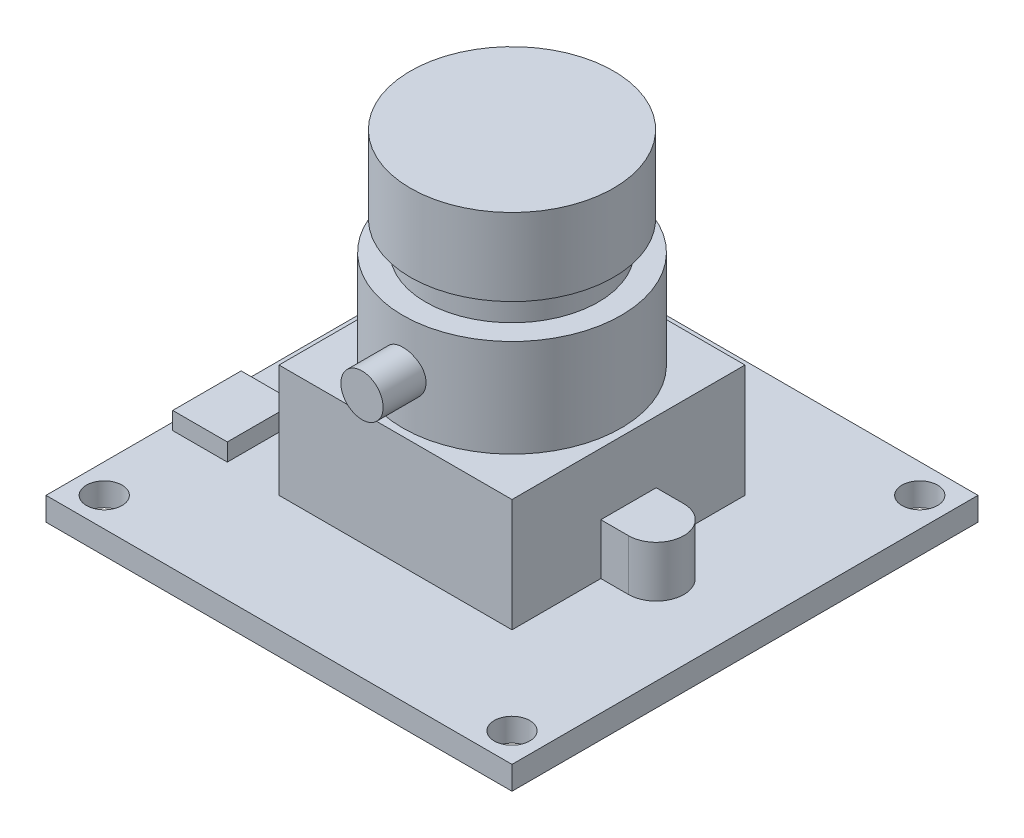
ISO-10303-21;
HEADER;
FILE_DESCRIPTION(('STEP AP214'),'2;1');
FILE_NAME('part.step','',(''),(''),'','','');
FILE_SCHEMA(('AUTOMOTIVE_DESIGN { 1 0 10303 214 1 1 1 1 }'));
ENDSEC;
DATA;
#1=APPLICATION_CONTEXT('core data for automotive mechanical design processes');
#2=APPLICATION_PROTOCOL_DEFINITION('international standard','automotive_design',2000,#1);
#3=PRODUCT_CONTEXT('',#1,'mechanical');
#4=PRODUCT('Part','Part','',(#3));
#5=PRODUCT_RELATED_PRODUCT_CATEGORY('part','',(#4));
#6=PRODUCT_DEFINITION_FORMATION('','',#4);
#7=PRODUCT_DEFINITION_CONTEXT('part definition',#1,'design');
#8=PRODUCT_DEFINITION('design','',#6,#7);
#9=PRODUCT_DEFINITION_SHAPE('','',#8);
#10=(LENGTH_UNIT() NAMED_UNIT(*) SI_UNIT(.MILLI.,.METRE.));
#11=(NAMED_UNIT(*) PLANE_ANGLE_UNIT() SI_UNIT($,.RADIAN.));
#12=(NAMED_UNIT(*) SI_UNIT($,.STERADIAN.) SOLID_ANGLE_UNIT());
#13=UNCERTAINTY_MEASURE_WITH_UNIT(LENGTH_MEASURE(1.E-05),#10,'distance_accuracy_value','');
#14=(GEOMETRIC_REPRESENTATION_CONTEXT(3) GLOBAL_UNCERTAINTY_ASSIGNED_CONTEXT((#13)) GLOBAL_UNIT_ASSIGNED_CONTEXT((#10,
#11,#12)) REPRESENTATION_CONTEXT('',''));
#15=CARTESIAN_POINT('',(0.,0.,0.));
#16=DIRECTION('',(0.,0.,1.));
#17=DIRECTION('',(1.,0.,0.));
#18=AXIS2_PLACEMENT_3D('',#15,#16,#17);
#19=CARTESIAN_POINT('',(16.,12.7,-11.3));
#20=DIRECTION('',(0.,0.,1.));
#21=DIRECTION('',(1.,0.,0.));
#22=AXIS2_PLACEMENT_3D('',#19,#20,#21);
#23=CYLINDRICAL_SURFACE('',#22,1.45);
#24=CARTESIAN_POINT('',(16.,12.7,-11.3));
#25=DIRECTION('',(0.,0.,1.));
#26=DIRECTION('',(1.,0.,0.));
#27=AXIS2_PLACEMENT_3D('',#24,#25,#26);
#28=CIRCLE('',#27,1.45);
#29=CARTESIAN_POINT('',(17.45,12.7,-11.3));
#30=VERTEX_POINT('',#29);
#31=EDGE_CURVE('E13',#30,#30,#28,.T.);
#32=ORIENTED_EDGE('',*,*,#31,.T.);
#33=EDGE_LOOP('',(#32));
#34=FACE_BOUND('',#33,.T.);
#35=CARTESIAN_POINT('',(16.,12.7,-5.7));
#36=DIRECTION('',(0.,0.,1.));
#37=DIRECTION('',(1.,0.,0.));
#38=AXIS2_PLACEMENT_3D('',#35,#36,#37);
#39=CIRCLE('',#38,1.45);
#40=CARTESIAN_POINT('',(17.45,12.7,-5.7));
#41=VERTEX_POINT('',#40);
#42=EDGE_CURVE('E63',#41,#41,#39,.T.);
#43=ORIENTED_EDGE('',*,*,#42,.F.);
#44=EDGE_LOOP('',(#43));
#45=FACE_BOUND('',#44,.T.);
#46=ADVANCED_FACE('F57',(#34,#45),#23,.T.);
#47=CARTESIAN_POINT('',(16.,12.7,-11.3));
#48=DIRECTION('',(0.,0.,1.));
#49=DIRECTION('',(1.,0.,0.));
#50=AXIS2_PLACEMENT_3D('',#47,#48,#49);
#51=PLANE('',#50);
#52=ORIENTED_EDGE('',*,*,#31,.F.);
#53=EDGE_LOOP('',(#52));
#54=FACE_BOUND('',#53,.T.);
#55=ADVANCED_FACE('F72',(#54),#51,.F.);
#56=CARTESIAN_POINT('',(16.,12.7,-5.7));
#57=DIRECTION('',(0.,0.,1.));
#58=DIRECTION('',(1.,0.,0.));
#59=AXIS2_PLACEMENT_3D('',#56,#57,#58);
#60=PLANE('',#59);
#61=ORIENTED_EDGE('',*,*,#42,.T.);
#62=EDGE_LOOP('',(#61));
#63=FACE_BOUND('',#62,.T.);
#64=ADVANCED_FACE('F69',(#63),#60,.T.);
#65=CLOSED_SHELL('',(#46,#55,#64));
#66=MANIFOLD_SOLID_BREP('B2',#65);
#67=CARTESIAN_POINT('',(0.,0.,0.));
#68=DIRECTION('',(0.,-1.,0.));
#69=DIRECTION('',(0.,0.,-1.));
#70=AXIS2_PLACEMENT_3D('',#67,#68,#69);
#71=PLANE('',#70);
#72=CARTESIAN_POINT('',(30.,0.,-2.));
#73=DIRECTION('',(0.,1.,0.));
#74=DIRECTION('',(0.,0.,1.));
#75=AXIS2_PLACEMENT_3D('',#72,#73,#74);
#76=CIRCLE('',#75,1.22);
#77=CARTESIAN_POINT('',(30.,0.,-0.779999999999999));
#78=VERTEX_POINT('',#77);
#79=EDGE_CURVE('E435',#78,#78,#76,.T.);
#80=ORIENTED_EDGE('',*,*,#79,.T.);
#81=EDGE_LOOP('',(#80));
#82=FACE_BOUND('',#81,.T.);
#83=CARTESIAN_POINT('',(2.,0.,-30.));
#84=DIRECTION('',(0.,1.,0.));
#85=DIRECTION('',(0.,0.,1.));
#86=AXIS2_PLACEMENT_3D('',#83,#84,#85);
#87=CIRCLE('',#86,1.22);
#88=CARTESIAN_POINT('',(2.,0.,-28.78));
#89=VERTEX_POINT('',#88);
#90=EDGE_CURVE('E447',#89,#89,#87,.T.);
#91=ORIENTED_EDGE('',*,*,#90,.T.);
#92=EDGE_LOOP('',(#91));
#93=FACE_BOUND('',#92,.T.);
#94=DIRECTION('',(0.,0.,1.));
#95=VECTOR('',#94,1.);
#96=CARTESIAN_POINT('',(0.,0.,0.));
#97=LINE('',#96,#95);
#98=CARTESIAN_POINT('',(0.,0.,-32.));
#99=VERTEX_POINT('',#98);
#100=CARTESIAN_POINT('',(0.,0.,0.));
#101=VERTEX_POINT('',#100);
#102=EDGE_CURVE('E453',#99,#101,#97,.T.);
#103=ORIENTED_EDGE('',*,*,#102,.F.);
#104=DIRECTION('',(-1.,0.,0.));
#105=VECTOR('',#104,1.);
#106=CARTESIAN_POINT('',(0.,0.,-32.));
#107=LINE('',#106,#105);
#108=CARTESIAN_POINT('',(32.,0.,-32.));
#109=VERTEX_POINT('',#108);
#110=EDGE_CURVE('E460',#109,#99,#107,.T.);
#111=ORIENTED_EDGE('',*,*,#110,.F.);
#112=DIRECTION('',(0.,0.,-1.));
#113=VECTOR('',#112,1.);
#114=CARTESIAN_POINT('',(32.,0.,0.));
#115=LINE('',#114,#113);
#116=CARTESIAN_POINT('',(32.,0.,0.));
#117=VERTEX_POINT('',#116);
#118=EDGE_CURVE('E471',#117,#109,#115,.T.);
#119=ORIENTED_EDGE('',*,*,#118,.F.);
#120=DIRECTION('',(1.,0.,0.));
#121=VECTOR('',#120,1.);
#122=CARTESIAN_POINT('',(0.,0.,0.));
#123=LINE('',#122,#121);
#124=EDGE_CURVE('E469',#101,#117,#123,.T.);
#125=ORIENTED_EDGE('',*,*,#124,.F.);
#126=EDGE_LOOP('',(#103,#111,#119,#125));
#127=FACE_BOUND('',#126,.T.);
#128=CARTESIAN_POINT('',(2.,0.,-2.));
#129=DIRECTION('',(0.,1.,0.));
#130=DIRECTION('',(0.,0.,1.));
#131=AXIS2_PLACEMENT_3D('',#128,#129,#130);
#132=CIRCLE('',#131,1.22);
#133=CARTESIAN_POINT('',(2.,0.,-0.78));
#134=VERTEX_POINT('',#133);
#135=EDGE_CURVE('E441',#134,#134,#132,.T.);
#136=ORIENTED_EDGE('',*,*,#135,.T.);
#137=EDGE_LOOP('',(#136));
#138=FACE_BOUND('',#137,.T.);
#139=CARTESIAN_POINT('',(30.,0.,-30.));
#140=DIRECTION('',(0.,1.,0.));
#141=DIRECTION('',(0.,0.,1.));
#142=AXIS2_PLACEMENT_3D('',#139,#140,#141);
#143=CIRCLE('',#142,1.22);
#144=CARTESIAN_POINT('',(30.,0.,-28.78));
#145=VERTEX_POINT('',#144);
#146=EDGE_CURVE('E431',#145,#145,#143,.T.);
#147=ORIENTED_EDGE('',*,*,#146,.T.);
#148=EDGE_LOOP('',(#147));
#149=FACE_BOUND('',#148,.T.);
#150=DIRECTION('',(1.,0.,0.));
#151=VECTOR('',#150,1.);
#152=CARTESIAN_POINT('',(5.9,0.,-31.75));
#153=LINE('',#152,#151);
#154=CARTESIAN_POINT('',(5.9,0.,-31.75));
#155=VERTEX_POINT('',#154);
#156=CARTESIAN_POINT('',(15.9,0.,-31.75));
#157=VERTEX_POINT('',#156);
#158=EDGE_CURVE('E881',#155,#157,#153,.T.);
#159=ORIENTED_EDGE('',*,*,#158,.F.);
#160=DIRECTION('',(0.,0.,-1.));
#161=VECTOR('',#160,1.);
#162=CARTESIAN_POINT('',(5.9,0.,-27.05));
#163=LINE('',#162,#161);
#164=CARTESIAN_POINT('',(5.9,0.,-27.05));
#165=VERTEX_POINT('',#164);
#166=EDGE_CURVE('E288',#165,#155,#163,.T.);
#167=ORIENTED_EDGE('',*,*,#166,.F.);
#168=DIRECTION('',(-1.,0.,0.));
#169=VECTOR('',#168,1.);
#170=CARTESIAN_POINT('',(5.9,0.,-27.05));
#171=LINE('',#170,#169);
#172=CARTESIAN_POINT('',(15.9,0.,-27.05));
#173=VERTEX_POINT('',#172);
#174=EDGE_CURVE('E284',#173,#165,#171,.T.);
#175=ORIENTED_EDGE('',*,*,#174,.F.);
#176=DIRECTION('',(0.,0.,1.));
#177=VECTOR('',#176,1.);
#178=CARTESIAN_POINT('',(15.9,0.,-27.05));
#179=LINE('',#178,#177);
#180=EDGE_CURVE('E878',#157,#173,#179,.T.);
#181=ORIENTED_EDGE('',*,*,#180,.F.);
#182=EDGE_LOOP('',(#159,#167,#175,#181));
#183=FACE_BOUND('',#182,.T.);
#184=ADVANCED_FACE('F104',(#82,#93,#127,#138,#149,#183),#71,.T.);
#185=CARTESIAN_POINT('',(0.,1.6,0.));
#186=DIRECTION('',(0.,-1.,0.));
#187=DIRECTION('',(0.,0.,-1.));
#188=AXIS2_PLACEMENT_3D('',#185,#186,#187);
#189=PLANE('',#188);
#190=DIRECTION('',(-1.,0.,0.));
#191=VECTOR('',#190,1.);
#192=CARTESIAN_POINT('',(25.9,1.6,-17.9));
#193=LINE('',#192,#191);
#194=CARTESIAN_POINT('',(25.9,1.6,-17.9));
#195=VERTEX_POINT('',#194);
#196=CARTESIAN_POINT('',(24.,1.6,-17.9));
#197=VERTEX_POINT('',#196);
#198=EDGE_CURVE('E339',#195,#197,#193,.T.);
#199=ORIENTED_EDGE('',*,*,#198,.F.);
#200=CARTESIAN_POINT('',(25.9,1.6,-16.));
#201=DIRECTION('',(0.,1.,0.));
#202=DIRECTION('',(0.,0.,1.));
#203=AXIS2_PLACEMENT_3D('',#200,#201,#202);
#204=CIRCLE('',#203,1.9);
#205=CARTESIAN_POINT('',(25.9,1.6,-14.1));
#206=VERTEX_POINT('',#205);
#207=EDGE_CURVE('E324',#206,#195,#204,.T.);
#208=ORIENTED_EDGE('',*,*,#207,.F.);
#209=DIRECTION('',(1.,0.,0.));
#210=VECTOR('',#209,1.);
#211=CARTESIAN_POINT('',(24.,1.6,-14.1));
#212=LINE('',#211,#210);
#213=CARTESIAN_POINT('',(24.,1.6,-14.1));
#214=VERTEX_POINT('',#213);
#215=EDGE_CURVE('E329',#214,#206,#212,.T.);
#216=ORIENTED_EDGE('',*,*,#215,.F.);
#217=DIRECTION('',(0.,0.,-1.));
#218=VECTOR('',#217,1.);
#219=CARTESIAN_POINT('',(24.,1.6,-24.));
#220=LINE('',#219,#218);
#221=CARTESIAN_POINT('',(24.,1.6,-8.));
#222=VERTEX_POINT('',#221);
#223=EDGE_CURVE('E415',#222,#214,#220,.T.);
#224=ORIENTED_EDGE('',*,*,#223,.F.);
#225=DIRECTION('',(1.,0.,0.));
#226=VECTOR('',#225,1.);
#227=CARTESIAN_POINT('',(8.,1.6,-8.));
#228=LINE('',#227,#226);
#229=CARTESIAN_POINT('',(8.,1.6,-8.));
#230=VERTEX_POINT('',#229);
#231=EDGE_CURVE('E411',#230,#222,#228,.T.);
#232=ORIENTED_EDGE('',*,*,#231,.F.);
#233=DIRECTION('',(0.,0.,1.));
#234=VECTOR('',#233,1.);
#235=CARTESIAN_POINT('',(8.00000000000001,1.6,-24.));
#236=LINE('',#235,#234);
#237=CARTESIAN_POINT('',(8.00000000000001,1.6,-14.1));
#238=VERTEX_POINT('',#237);
#239=EDGE_CURVE('E394',#238,#230,#236,.T.);
#240=ORIENTED_EDGE('',*,*,#239,.F.);
#241=DIRECTION('',(1.,0.,0.));
#242=VECTOR('',#241,1.);
#243=CARTESIAN_POINT('',(8.00000000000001,1.6,-14.1));
#244=LINE('',#243,#242);
#245=CARTESIAN_POINT('',(6.1,1.6,-14.1));
#246=VERTEX_POINT('',#245);
#247=EDGE_CURVE('E366',#246,#238,#244,.T.);
#248=ORIENTED_EDGE('',*,*,#247,.F.);
#249=CARTESIAN_POINT('',(6.10000000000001,1.6,-16.));
#250=DIRECTION('',(0.,1.,0.));
#251=DIRECTION('',(0.,0.,1.));
#252=AXIS2_PLACEMENT_3D('',#249,#250,#251);
#253=CIRCLE('',#252,1.9);
#254=CARTESIAN_POINT('',(6.1,1.6,-17.9));
#255=VERTEX_POINT('',#254);
#256=EDGE_CURVE('E351',#255,#246,#253,.T.);
#257=ORIENTED_EDGE('',*,*,#256,.F.);
#258=DIRECTION('',(-1.,0.,0.));
#259=VECTOR('',#258,1.);
#260=CARTESIAN_POINT('',(6.1,1.6,-17.9));
#261=LINE('',#260,#259);
#262=CARTESIAN_POINT('',(8.00000000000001,1.6,-17.9));
#263=VERTEX_POINT('',#262);
#264=EDGE_CURVE('E356',#263,#255,#261,.T.);
#265=ORIENTED_EDGE('',*,*,#264,.F.);
#266=CARTESIAN_POINT('',(8.00000000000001,1.6,-24.));
#267=VERTEX_POINT('',#266);
#268=EDGE_CURVE('E408',#267,#263,#236,.T.);
#269=ORIENTED_EDGE('',*,*,#268,.F.);
#270=DIRECTION('',(-1.,0.,0.));
#271=VECTOR('',#270,1.);
#272=CARTESIAN_POINT('',(8.00000000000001,1.6,-24.));
#273=LINE('',#272,#271);
#274=CARTESIAN_POINT('',(24.,1.6,-24.));
#275=VERTEX_POINT('',#274);
#276=EDGE_CURVE('E401',#275,#267,#273,.T.);
#277=ORIENTED_EDGE('',*,*,#276,.F.);
#278=EDGE_CURVE('E414',#197,#275,#220,.T.);
#279=ORIENTED_EDGE('',*,*,#278,.F.);
#280=EDGE_LOOP('',(#199,#208,#216,#224,#232,#240,#248,#257,#265,#269,#277,#279));
#281=FACE_BOUND('',#280,.T.);
#282=CARTESIAN_POINT('',(30.,1.6,-2.));
#283=DIRECTION('',(0.,1.,0.));
#284=DIRECTION('',(0.,0.,1.));
#285=AXIS2_PLACEMENT_3D('',#282,#283,#284);
#286=CIRCLE('',#285,1.22);
#287=CARTESIAN_POINT('',(30.,1.6,-0.779999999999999));
#288=VERTEX_POINT('',#287);
#289=EDGE_CURVE('E438',#288,#288,#286,.T.);
#290=ORIENTED_EDGE('',*,*,#289,.F.);
#291=EDGE_LOOP('',(#290));
#292=FACE_BOUND('',#291,.T.);
#293=CARTESIAN_POINT('',(2.,1.6,-30.));
#294=DIRECTION('',(0.,1.,0.));
#295=DIRECTION('',(0.,0.,1.));
#296=AXIS2_PLACEMENT_3D('',#293,#294,#295);
#297=CIRCLE('',#296,1.22);
#298=CARTESIAN_POINT('',(2.,1.6,-28.78));
#299=VERTEX_POINT('',#298);
#300=EDGE_CURVE('E450',#299,#299,#297,.T.);
#301=ORIENTED_EDGE('',*,*,#300,.F.);
#302=EDGE_LOOP('',(#301));
#303=FACE_BOUND('',#302,.T.);
#304=DIRECTION('',(0.,0.,1.));
#305=VECTOR('',#304,1.);
#306=CARTESIAN_POINT('',(0.,1.6,0.));
#307=LINE('',#306,#305);
#308=CARTESIAN_POINT('',(0.,1.6,-32.));
#309=VERTEX_POINT('',#308);
#310=CARTESIAN_POINT('',(0.,1.6,0.));
#311=VERTEX_POINT('',#310);
#312=EDGE_CURVE('E456',#309,#311,#307,.T.);
#313=ORIENTED_EDGE('',*,*,#312,.T.);
#314=DIRECTION('',(1.,0.,0.));
#315=VECTOR('',#314,1.);
#316=CARTESIAN_POINT('',(0.,1.6,0.));
#317=LINE('',#316,#315);
#318=CARTESIAN_POINT('',(32.,1.6,0.));
#319=VERTEX_POINT('',#318);
#320=EDGE_CURVE('E459',#311,#319,#317,.T.);
#321=ORIENTED_EDGE('',*,*,#320,.T.);
#322=DIRECTION('',(0.,0.,-1.));
#323=VECTOR('',#322,1.);
#324=CARTESIAN_POINT('',(32.,1.6,0.));
#325=LINE('',#324,#323);
#326=CARTESIAN_POINT('',(32.,1.6,-32.));
#327=VERTEX_POINT('',#326);
#328=EDGE_CURVE('E462',#319,#327,#325,.T.);
#329=ORIENTED_EDGE('',*,*,#328,.T.);
#330=DIRECTION('',(-1.,0.,0.));
#331=VECTOR('',#330,1.);
#332=CARTESIAN_POINT('',(0.,1.6,-32.));
#333=LINE('',#332,#331);
#334=EDGE_CURVE('E464',#327,#309,#333,.T.);
#335=ORIENTED_EDGE('',*,*,#334,.T.);
#336=EDGE_LOOP('',(#313,#321,#329,#335));
#337=FACE_BOUND('',#336,.T.);
#338=CARTESIAN_POINT('',(2.,1.6,-2.));
#339=DIRECTION('',(0.,1.,0.));
#340=DIRECTION('',(0.,0.,1.));
#341=AXIS2_PLACEMENT_3D('',#338,#339,#340);
#342=CIRCLE('',#341,1.22);
#343=CARTESIAN_POINT('',(2.,1.6,-0.78));
#344=VERTEX_POINT('',#343);
#345=EDGE_CURVE('E444',#344,#344,#342,.T.);
#346=ORIENTED_EDGE('',*,*,#345,.F.);
#347=EDGE_LOOP('',(#346));
#348=FACE_BOUND('',#347,.T.);
#349=CARTESIAN_POINT('',(30.,1.6,-30.));
#350=DIRECTION('',(0.,1.,0.));
#351=DIRECTION('',(0.,0.,1.));
#352=AXIS2_PLACEMENT_3D('',#349,#350,#351);
#353=CIRCLE('',#352,1.22);
#354=CARTESIAN_POINT('',(30.,1.6,-28.78));
#355=VERTEX_POINT('',#354);
#356=EDGE_CURVE('E432',#355,#355,#353,.T.);
#357=ORIENTED_EDGE('',*,*,#356,.F.);
#358=EDGE_LOOP('',(#357));
#359=FACE_BOUND('',#358,.T.);
#360=DIRECTION('',(0.,0.,-1.));
#361=VECTOR('',#360,1.);
#362=CARTESIAN_POINT('',(4.25,1.6,-8.2));
#363=LINE('',#362,#361);
#364=CARTESIAN_POINT('',(4.25,1.6,-8.2));
#365=VERTEX_POINT('',#364);
#366=CARTESIAN_POINT('',(4.25,1.6,-12.9));
#367=VERTEX_POINT('',#366);
#368=EDGE_CURVE('E290',#365,#367,#363,.T.);
#369=ORIENTED_EDGE('',*,*,#368,.F.);
#370=DIRECTION('',(1.,0.,0.));
#371=VECTOR('',#370,1.);
#372=CARTESIAN_POINT('',(4.25,1.6,-8.2));
#373=LINE('',#372,#371);
#374=CARTESIAN_POINT('',(0.5,1.6,-8.2));
#375=VERTEX_POINT('',#374);
#376=EDGE_CURVE('E301',#375,#365,#373,.T.);
#377=ORIENTED_EDGE('',*,*,#376,.F.);
#378=DIRECTION('',(0.,0.,1.));
#379=VECTOR('',#378,1.);
#380=CARTESIAN_POINT('',(0.5,1.6,-8.2));
#381=LINE('',#380,#379);
#382=CARTESIAN_POINT('',(0.5,1.6,-12.9));
#383=VERTEX_POINT('',#382);
#384=EDGE_CURVE('E309',#383,#375,#381,.T.);
#385=ORIENTED_EDGE('',*,*,#384,.F.);
#386=DIRECTION('',(-1.,0.,0.));
#387=VECTOR('',#386,1.);
#388=CARTESIAN_POINT('',(4.25,1.6,-12.9));
#389=LINE('',#388,#387);
#390=EDGE_CURVE('E127',#367,#383,#389,.T.);
#391=ORIENTED_EDGE('',*,*,#390,.F.);
#392=EDGE_LOOP('',(#369,#377,#385,#391));
#393=FACE_BOUND('',#392,.T.);
#394=ADVANCED_FACE('F498',(#281,#292,#303,#337,#348,#359,#393),#189,.F.);
#395=CARTESIAN_POINT('',(24.,9.35,-24.));
#396=DIRECTION('',(-1.,0.,0.));
#397=DIRECTION('',(0.,0.,1.));
#398=AXIS2_PLACEMENT_3D('',#395,#396,#397);
#399=PLANE('',#398);
#400=DIRECTION('',(0.,-1.,0.));
#401=VECTOR('',#400,1.);
#402=CARTESIAN_POINT('',(24.,5.1,-17.9));
#403=LINE('',#402,#401);
#404=CARTESIAN_POINT('',(24.,5.1,-17.9));
#405=VERTEX_POINT('',#404);
#406=EDGE_CURVE('E346',#405,#197,#403,.T.);
#407=ORIENTED_EDGE('',*,*,#406,.T.);
#408=ORIENTED_EDGE('',*,*,#278,.T.);
#409=DIRECTION('',(0.,-1.,0.));
#410=VECTOR('',#409,1.);
#411=CARTESIAN_POINT('',(24.,9.35,-24.));
#412=LINE('',#411,#410);
#413=CARTESIAN_POINT('',(24.,9.35,-24.));
#414=VERTEX_POINT('',#413);
#415=EDGE_CURVE('E422',#414,#275,#412,.T.);
#416=ORIENTED_EDGE('',*,*,#415,.F.);
#417=DIRECTION('',(0.,0.,-1.));
#418=VECTOR('',#417,1.);
#419=CARTESIAN_POINT('',(24.,9.35,-24.));
#420=LINE('',#419,#418);
#421=CARTESIAN_POINT('',(24.,9.35,-8.));
#422=VERTEX_POINT('',#421);
#423=EDGE_CURVE('E403',#422,#414,#420,.T.);
#424=ORIENTED_EDGE('',*,*,#423,.F.);
#425=DIRECTION('',(0.,-1.,0.));
#426=VECTOR('',#425,1.);
#427=CARTESIAN_POINT('',(24.,9.35,-8.));
#428=LINE('',#427,#426);
#429=EDGE_CURVE('E425',#422,#222,#428,.T.);
#430=ORIENTED_EDGE('',*,*,#429,.T.);
#431=ORIENTED_EDGE('',*,*,#223,.T.);
#432=DIRECTION('',(0.,-1.,0.));
#433=VECTOR('',#432,1.);
#434=CARTESIAN_POINT('',(24.,5.1,-14.1));
#435=LINE('',#434,#433);
#436=CARTESIAN_POINT('',(24.,5.1,-14.1));
#437=VERTEX_POINT('',#436);
#438=EDGE_CURVE('E344',#437,#214,#435,.T.);
#439=ORIENTED_EDGE('',*,*,#438,.F.);
#440=DIRECTION('',(0.,0.,1.));
#441=VECTOR('',#440,1.);
#442=CARTESIAN_POINT('',(24.,5.1,-17.9));
#443=LINE('',#442,#441);
#444=EDGE_CURVE('E332',#405,#437,#443,.T.);
#445=ORIENTED_EDGE('',*,*,#444,.F.);
#446=EDGE_LOOP('',(#407,#408,#416,#424,#430,#431,#439,#445));
#447=FACE_BOUND('',#446,.T.);
#448=ADVANCED_FACE('F514',(#447),#399,.F.);
#449=CARTESIAN_POINT('',(8.00000000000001,9.35,-24.));
#450=DIRECTION('',(1.,0.,0.));
#451=DIRECTION('',(0.,0.,-1.));
#452=AXIS2_PLACEMENT_3D('',#449,#450,#451);
#453=PLANE('',#452);
#454=DIRECTION('',(0.,-1.,0.));
#455=VECTOR('',#454,1.);
#456=CARTESIAN_POINT('',(8.00000000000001,5.1,-14.1));
#457=LINE('',#456,#455);
#458=CARTESIAN_POINT('',(8.,5.1,-14.1));
#459=VERTEX_POINT('',#458);
#460=EDGE_CURVE('E373',#459,#238,#457,.T.);
#461=ORIENTED_EDGE('',*,*,#460,.T.);
#462=ORIENTED_EDGE('',*,*,#239,.T.);
#463=DIRECTION('',(0.,-1.,0.));
#464=VECTOR('',#463,1.);
#465=CARTESIAN_POINT('',(8.,9.35,-8.));
#466=LINE('',#465,#464);
#467=CARTESIAN_POINT('',(8.,9.35,-8.));
#468=VERTEX_POINT('',#467);
#469=EDGE_CURVE('E428',#468,#230,#466,.T.);
#470=ORIENTED_EDGE('',*,*,#469,.F.);
#471=DIRECTION('',(0.,0.,1.));
#472=VECTOR('',#471,1.);
#473=CARTESIAN_POINT('',(8.00000000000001,9.35,-24.));
#474=LINE('',#473,#472);
#475=CARTESIAN_POINT('',(8.00000000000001,9.35,-24.));
#476=VERTEX_POINT('',#475);
#477=EDGE_CURVE('E397',#476,#468,#474,.T.);
#478=ORIENTED_EDGE('',*,*,#477,.F.);
#479=DIRECTION('',(0.,-1.,0.));
#480=VECTOR('',#479,1.);
#481=CARTESIAN_POINT('',(8.00000000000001,9.35,-24.));
#482=LINE('',#481,#480);
#483=EDGE_CURVE('E407',#476,#267,#482,.T.);
#484=ORIENTED_EDGE('',*,*,#483,.T.);
#485=ORIENTED_EDGE('',*,*,#268,.T.);
#486=DIRECTION('',(0.,-1.,0.));
#487=VECTOR('',#486,1.);
#488=CARTESIAN_POINT('',(8.00000000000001,5.1,-17.9));
#489=LINE('',#488,#487);
#490=CARTESIAN_POINT('',(8.00000000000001,5.1,-17.9));
#491=VERTEX_POINT('',#490);
#492=EDGE_CURVE('E371',#491,#263,#489,.T.);
#493=ORIENTED_EDGE('',*,*,#492,.F.);
#494=DIRECTION('',(0.,0.,-1.));
#495=VECTOR('',#494,1.);
#496=CARTESIAN_POINT('',(8.00000000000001,5.1,-17.9));
#497=LINE('',#496,#495);
#498=EDGE_CURVE('E359',#459,#491,#497,.T.);
#499=ORIENTED_EDGE('',*,*,#498,.F.);
#500=EDGE_LOOP('',(#461,#462,#470,#478,#484,#485,#493,#499));
#501=FACE_BOUND('',#500,.T.);
#502=ADVANCED_FACE('F543',(#501),#453,.F.);
#503=CARTESIAN_POINT('',(16.,16.05,-16.));
#504=DIRECTION('',(0.,1.,0.));
#505=DIRECTION('',(0.,0.,1.));
#506=AXIS2_PLACEMENT_3D('',#503,#504,#505);
#507=PLANE('',#506);
#508=CARTESIAN_POINT('',(16.,16.05,-16.));
#509=DIRECTION('',(0.,1.,0.));
#510=DIRECTION('',(0.,0.,1.));
#511=AXIS2_PLACEMENT_3D('',#508,#509,#510);
#512=CIRCLE('',#511,7.5);
#513=CARTESIAN_POINT('',(16.,16.05,-8.5));
#514=VERTEX_POINT('',#513);
#515=EDGE_CURVE('E391',#514,#514,#512,.T.);
#516=ORIENTED_EDGE('',*,*,#515,.T.);
#517=EDGE_LOOP('',(#516));
#518=FACE_BOUND('',#517,.T.);
#519=CARTESIAN_POINT('',(16.,16.05,-16.));
#520=DIRECTION('',(0.,1.,0.));
#521=DIRECTION('',(0.,0.,1.));
#522=AXIS2_PLACEMENT_3D('',#519,#520,#521);
#523=CIRCLE('',#522,5.925);
#524=CARTESIAN_POINT('',(16.,16.05,-10.075));
#525=VERTEX_POINT('',#524);
#526=EDGE_CURVE('E382',#525,#525,#523,.T.);
#527=ORIENTED_EDGE('',*,*,#526,.F.);
#528=EDGE_LOOP('',(#527));
#529=FACE_BOUND('',#528,.T.);
#530=ADVANCED_FACE('F546',(#518,#529),#507,.T.);
#531=CARTESIAN_POINT('',(0.,9.35,0.));
#532=DIRECTION('',(0.,1.,0.));
#533=DIRECTION('',(0.,0.,1.));
#534=AXIS2_PLACEMENT_3D('',#531,#532,#533);
#535=PLANE('',#534);
#536=ORIENTED_EDGE('',*,*,#477,.T.);
#537=DIRECTION('',(1.,0.,0.));
#538=VECTOR('',#537,1.);
#539=CARTESIAN_POINT('',(8.,9.35,-8.));
#540=LINE('',#539,#538);
#541=EDGE_CURVE('E400',#468,#422,#540,.T.);
#542=ORIENTED_EDGE('',*,*,#541,.T.);
#543=ORIENTED_EDGE('',*,*,#423,.T.);
#544=DIRECTION('',(-1.,0.,0.));
#545=VECTOR('',#544,1.);
#546=CARTESIAN_POINT('',(8.00000000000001,9.35,-24.));
#547=LINE('',#546,#545);
#548=EDGE_CURVE('E405',#414,#476,#547,.T.);
#549=ORIENTED_EDGE('',*,*,#548,.T.);
#550=EDGE_LOOP('',(#536,#542,#543,#549));
#551=FACE_BOUND('',#550,.T.);
#552=CARTESIAN_POINT('',(16.,9.35,-16.));
#553=DIRECTION('',(0.,1.,0.));
#554=DIRECTION('',(0.,0.,1.));
#555=AXIS2_PLACEMENT_3D('',#552,#553,#554);
#556=CIRCLE('',#555,7.5);
#557=CARTESIAN_POINT('',(16.,9.35,-8.5));
#558=VERTEX_POINT('',#557);
#559=EDGE_CURVE('E388',#558,#558,#556,.T.);
#560=ORIENTED_EDGE('',*,*,#559,.F.);
#561=EDGE_LOOP('',(#560));
#562=FACE_BOUND('',#561,.T.);
#563=ADVANCED_FACE('F507',(#551,#562),#535,.T.);
#564=CARTESIAN_POINT('',(0.,1.6,0.));
#565=DIRECTION('',(1.,0.,0.));
#566=DIRECTION('',(0.,0.,-1.));
#567=AXIS2_PLACEMENT_3D('',#564,#565,#566);
#568=PLANE('',#567);
#569=ORIENTED_EDGE('',*,*,#102,.T.);
#570=DIRECTION('',(0.,-1.,0.));
#571=VECTOR('',#570,1.);
#572=CARTESIAN_POINT('',(0.,1.6,0.));
#573=LINE('',#572,#571);
#574=EDGE_CURVE('E55',#311,#101,#573,.T.);
#575=ORIENTED_EDGE('',*,*,#574,.F.);
#576=ORIENTED_EDGE('',*,*,#312,.F.);
#577=DIRECTION('',(0.,-1.,0.));
#578=VECTOR('',#577,1.);
#579=CARTESIAN_POINT('',(0.,1.6,-32.));
#580=LINE('',#579,#578);
#581=EDGE_CURVE('E466',#309,#99,#580,.T.);
#582=ORIENTED_EDGE('',*,*,#581,.T.);
#583=EDGE_LOOP('',(#569,#575,#576,#582));
#584=FACE_BOUND('',#583,.T.);
#585=ADVANCED_FACE('F106',(#584),#568,.F.);
#586=CARTESIAN_POINT('',(0.,1.6,0.));
#587=DIRECTION('',(0.,0.,-1.));
#588=DIRECTION('',(-1.,0.,0.));
#589=AXIS2_PLACEMENT_3D('',#586,#587,#588);
#590=PLANE('',#589);
#591=ORIENTED_EDGE('',*,*,#124,.T.);
#592=DIRECTION('',(0.,-1.,0.));
#593=VECTOR('',#592,1.);
#594=CARTESIAN_POINT('',(32.,1.6,0.));
#595=LINE('',#594,#593);
#596=EDGE_CURVE('E112',#319,#117,#595,.T.);
#597=ORIENTED_EDGE('',*,*,#596,.F.);
#598=ORIENTED_EDGE('',*,*,#320,.F.);
#599=ORIENTED_EDGE('',*,*,#574,.T.);
#600=EDGE_LOOP('',(#591,#597,#598,#599));
#601=FACE_BOUND('',#600,.T.);
#602=ADVANCED_FACE('F500',(#601),#590,.F.);
#603=CARTESIAN_POINT('',(32.,1.6,0.));
#604=DIRECTION('',(-1.,0.,0.));
#605=DIRECTION('',(0.,0.,1.));
#606=AXIS2_PLACEMENT_3D('',#603,#604,#605);
#607=PLANE('',#606);
#608=ORIENTED_EDGE('',*,*,#118,.T.);
#609=DIRECTION('',(0.,-1.,0.));
#610=VECTOR('',#609,1.);
#611=CARTESIAN_POINT('',(32.,1.6,-32.));
#612=LINE('',#611,#610);
#613=EDGE_CURVE('E476',#327,#109,#612,.T.);
#614=ORIENTED_EDGE('',*,*,#613,.F.);
#615=ORIENTED_EDGE('',*,*,#328,.F.);
#616=ORIENTED_EDGE('',*,*,#596,.T.);
#617=EDGE_LOOP('',(#608,#614,#615,#616));
#618=FACE_BOUND('',#617,.T.);
#619=ADVANCED_FACE('F483',(#618),#607,.F.);
#620=CARTESIAN_POINT('',(0.,1.6,-32.));
#621=DIRECTION('',(0.,0.,1.));
#622=DIRECTION('',(1.,0.,0.));
#623=AXIS2_PLACEMENT_3D('',#620,#621,#622);
#624=PLANE('',#623);
#625=ORIENTED_EDGE('',*,*,#110,.T.);
#626=ORIENTED_EDGE('',*,*,#581,.F.);
#627=ORIENTED_EDGE('',*,*,#334,.F.);
#628=ORIENTED_EDGE('',*,*,#613,.T.);
#629=EDGE_LOOP('',(#625,#626,#627,#628));
#630=FACE_BOUND('',#629,.T.);
#631=ADVANCED_FACE('F492',(#630),#624,.F.);
#632=CARTESIAN_POINT('',(2.,1.6,-30.));
#633=DIRECTION('',(0.,-1.,0.));
#634=DIRECTION('',(0.,0.,-1.));
#635=AXIS2_PLACEMENT_3D('',#632,#633,#634);
#636=CYLINDRICAL_SURFACE('',#635,1.22);
#637=ORIENTED_EDGE('',*,*,#300,.T.);
#638=EDGE_LOOP('',(#637));
#639=FACE_BOUND('',#638,.T.);
#640=ORIENTED_EDGE('',*,*,#90,.F.);
#641=EDGE_LOOP('',(#640));
#642=FACE_BOUND('',#641,.T.);
#643=ADVANCED_FACE('F521',(#639,#642),#636,.F.);
#644=CARTESIAN_POINT('',(2.,1.6,-2.));
#645=DIRECTION('',(0.,-1.,0.));
#646=DIRECTION('',(0.,0.,-1.));
#647=AXIS2_PLACEMENT_3D('',#644,#645,#646);
#648=CYLINDRICAL_SURFACE('',#647,1.22);
#649=ORIENTED_EDGE('',*,*,#345,.T.);
#650=EDGE_LOOP('',(#649));
#651=FACE_BOUND('',#650,.T.);
#652=ORIENTED_EDGE('',*,*,#135,.F.);
#653=EDGE_LOOP('',(#652));
#654=FACE_BOUND('',#653,.T.);
#655=ADVANCED_FACE('F525',(#651,#654),#648,.F.);
#656=CARTESIAN_POINT('',(30.,1.6,-2.));
#657=DIRECTION('',(0.,-1.,0.));
#658=DIRECTION('',(0.,0.,-1.));
#659=AXIS2_PLACEMENT_3D('',#656,#657,#658);
#660=CYLINDRICAL_SURFACE('',#659,1.22);
#661=ORIENTED_EDGE('',*,*,#289,.T.);
#662=EDGE_LOOP('',(#661));
#663=FACE_BOUND('',#662,.T.);
#664=ORIENTED_EDGE('',*,*,#79,.F.);
#665=EDGE_LOOP('',(#664));
#666=FACE_BOUND('',#665,.T.);
#667=ADVANCED_FACE('F530',(#663,#666),#660,.F.);
#668=CARTESIAN_POINT('',(30.,1.6,-30.));
#669=DIRECTION('',(0.,-1.,0.));
#670=DIRECTION('',(0.,0.,-1.));
#671=AXIS2_PLACEMENT_3D('',#668,#669,#670);
#672=CYLINDRICAL_SURFACE('',#671,1.22);
#673=ORIENTED_EDGE('',*,*,#356,.T.);
#674=EDGE_LOOP('',(#673));
#675=FACE_BOUND('',#674,.T.);
#676=ORIENTED_EDGE('',*,*,#146,.F.);
#677=EDGE_LOOP('',(#676));
#678=FACE_BOUND('',#677,.T.);
#679=ADVANCED_FACE('F537',(#675,#678),#672,.F.);
#680=CARTESIAN_POINT('',(8.,9.35,-8.));
#681=DIRECTION('',(0.,0.,-1.));
#682=DIRECTION('',(-1.,0.,0.));
#683=AXIS2_PLACEMENT_3D('',#680,#681,#682);
#684=PLANE('',#683);
#685=ORIENTED_EDGE('',*,*,#231,.T.);
#686=ORIENTED_EDGE('',*,*,#429,.F.);
#687=ORIENTED_EDGE('',*,*,#541,.F.);
#688=ORIENTED_EDGE('',*,*,#469,.T.);
#689=EDGE_LOOP('',(#685,#686,#687,#688));
#690=FACE_BOUND('',#689,.T.);
#691=ADVANCED_FACE('F541',(#690),#684,.F.);
#692=CARTESIAN_POINT('',(8.00000000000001,9.35,-24.));
#693=DIRECTION('',(0.,0.,1.));
#694=DIRECTION('',(1.,0.,0.));
#695=AXIS2_PLACEMENT_3D('',#692,#693,#694);
#696=PLANE('',#695);
#697=ORIENTED_EDGE('',*,*,#276,.T.);
#698=ORIENTED_EDGE('',*,*,#483,.F.);
#699=ORIENTED_EDGE('',*,*,#548,.F.);
#700=ORIENTED_EDGE('',*,*,#415,.T.);
#701=EDGE_LOOP('',(#697,#698,#699,#700));
#702=FACE_BOUND('',#701,.T.);
#703=ADVANCED_FACE('F550',(#702),#696,.F.);
#704=CARTESIAN_POINT('',(16.,16.05,-16.));
#705=DIRECTION('',(0.,-1.,0.));
#706=DIRECTION('',(0.,0.,-1.));
#707=AXIS2_PLACEMENT_3D('',#704,#705,#706);
#708=CYLINDRICAL_SURFACE('',#707,7.5);
#709=ORIENTED_EDGE('',*,*,#515,.F.);
#710=EDGE_LOOP('',(#709));
#711=FACE_BOUND('',#710,.T.);
#712=ORIENTED_EDGE('',*,*,#559,.T.);
#713=EDGE_LOOP('',(#712));
#714=FACE_BOUND('',#713,.T.);
#715=ADVANCED_FACE('F557',(#711,#714),#708,.T.);
#716=CARTESIAN_POINT('',(16.,18.05,-16.));
#717=DIRECTION('',(0.,-1.,0.));
#718=DIRECTION('',(0.,0.,-1.));
#719=AXIS2_PLACEMENT_3D('',#716,#717,#718);
#720=CYLINDRICAL_SURFACE('',#719,5.925);
#721=CARTESIAN_POINT('',(16.,18.05,-16.));
#722=DIRECTION('',(0.,1.,0.));
#723=DIRECTION('',(0.,0.,1.));
#724=AXIS2_PLACEMENT_3D('',#721,#722,#723);
#725=CIRCLE('',#724,5.925);
#726=CARTESIAN_POINT('',(16.,18.05,-10.075));
#727=VERTEX_POINT('',#726);
#728=EDGE_CURVE('E385',#727,#727,#725,.T.);
#729=ORIENTED_EDGE('',*,*,#728,.F.);
#730=EDGE_LOOP('',(#729));
#731=FACE_BOUND('',#730,.T.);
#732=ORIENTED_EDGE('',*,*,#526,.T.);
#733=EDGE_LOOP('',(#732));
#734=FACE_BOUND('',#733,.T.);
#735=ADVANCED_FACE('F564',(#731,#734),#720,.T.);
#736=CARTESIAN_POINT('',(16.,18.05,-16.));
#737=DIRECTION('',(0.,1.,0.));
#738=DIRECTION('',(0.,0.,1.));
#739=AXIS2_PLACEMENT_3D('',#736,#737,#738);
#740=PLANE('',#739);
#741=CARTESIAN_POINT('',(16.,18.05,-16.));
#742=DIRECTION('',(0.,1.,0.));
#743=DIRECTION('',(0.,0.,1.));
#744=AXIS2_PLACEMENT_3D('',#741,#742,#743);
#745=CIRCLE('',#744,6.975);
#746=CARTESIAN_POINT('',(16.,18.05,-9.025));
#747=VERTEX_POINT('',#746);
#748=EDGE_CURVE('E378',#747,#747,#745,.T.);
#749=ORIENTED_EDGE('',*,*,#748,.F.);
#750=EDGE_LOOP('',(#749));
#751=FACE_BOUND('',#750,.T.);
#752=ORIENTED_EDGE('',*,*,#728,.T.);
#753=EDGE_LOOP('',(#752));
#754=FACE_BOUND('',#753,.T.);
#755=ADVANCED_FACE('F571',(#751,#754),#740,.F.);
#756=CARTESIAN_POINT('',(16.,23.35,-16.));
#757=DIRECTION('',(0.,-1.,0.));
#758=DIRECTION('',(0.,0.,-1.));
#759=AXIS2_PLACEMENT_3D('',#756,#757,#758);
#760=CYLINDRICAL_SURFACE('',#759,6.975);
#761=CARTESIAN_POINT('',(16.,23.35,-16.));
#762=DIRECTION('',(0.,1.,0.));
#763=DIRECTION('',(0.,0.,1.));
#764=AXIS2_PLACEMENT_3D('',#761,#762,#763);
#765=CIRCLE('',#764,6.975);
#766=CARTESIAN_POINT('',(16.,23.35,-9.025));
#767=VERTEX_POINT('',#766);
#768=EDGE_CURVE('E379',#767,#767,#765,.T.);
#769=ORIENTED_EDGE('',*,*,#768,.F.);
#770=EDGE_LOOP('',(#769));
#771=FACE_BOUND('',#770,.T.);
#772=ORIENTED_EDGE('',*,*,#748,.T.);
#773=EDGE_LOOP('',(#772));
#774=FACE_BOUND('',#773,.T.);
#775=ADVANCED_FACE('F573',(#771,#774),#760,.T.);
#776=CARTESIAN_POINT('',(16.,23.35,-16.));
#777=DIRECTION('',(0.,1.,0.));
#778=DIRECTION('',(0.,0.,1.));
#779=AXIS2_PLACEMENT_3D('',#776,#777,#778);
#780=PLANE('',#779);
#781=ORIENTED_EDGE('',*,*,#768,.T.);
#782=EDGE_LOOP('',(#781));
#783=FACE_BOUND('',#782,.T.);
#784=ADVANCED_FACE('F576',(#783),#780,.T.);
#785=CARTESIAN_POINT('',(6.10000000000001,5.1,-16.));
#786=DIRECTION('',(0.,-1.,0.));
#787=DIRECTION('',(0.,0.,-1.));
#788=AXIS2_PLACEMENT_3D('',#785,#786,#787);
#789=CYLINDRICAL_SURFACE('',#788,1.9);
#790=ORIENTED_EDGE('',*,*,#256,.T.);
#791=DIRECTION('',(0.,-1.,0.));
#792=VECTOR('',#791,1.);
#793=CARTESIAN_POINT('',(6.1,5.1,-14.1));
#794=LINE('',#793,#792);
#795=CARTESIAN_POINT('',(6.1,5.1,-14.1));
#796=VERTEX_POINT('',#795);
#797=EDGE_CURVE('E376',#796,#246,#794,.T.);
#798=ORIENTED_EDGE('',*,*,#797,.F.);
#799=CARTESIAN_POINT('',(6.10000000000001,5.1,-16.));
#800=DIRECTION('',(0.,1.,0.));
#801=DIRECTION('',(0.,0.,1.));
#802=AXIS2_PLACEMENT_3D('',#799,#800,#801);
#803=CIRCLE('',#802,1.9);
#804=CARTESIAN_POINT('',(6.1,5.1,-17.9));
#805=VERTEX_POINT('',#804);
#806=EDGE_CURVE('E352',#805,#796,#803,.T.);
#807=ORIENTED_EDGE('',*,*,#806,.F.);
#808=DIRECTION('',(0.,-1.,0.));
#809=VECTOR('',#808,1.);
#810=CARTESIAN_POINT('',(6.1,5.1,-17.9));
#811=LINE('',#810,#809);
#812=EDGE_CURVE('E363',#805,#255,#811,.T.);
#813=ORIENTED_EDGE('',*,*,#812,.T.);
#814=EDGE_LOOP('',(#790,#798,#807,#813));
#815=FACE_BOUND('',#814,.T.);
#816=ADVANCED_FACE('F583',(#815),#789,.T.);
#817=CARTESIAN_POINT('',(8.00000000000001,5.1,-14.1));
#818=DIRECTION('',(0.,0.,-1.));
#819=DIRECTION('',(-1.,0.,0.));
#820=AXIS2_PLACEMENT_3D('',#817,#818,#819);
#821=PLANE('',#820);
#822=ORIENTED_EDGE('',*,*,#247,.T.);
#823=ORIENTED_EDGE('',*,*,#460,.F.);
#824=DIRECTION('',(1.,0.,0.));
#825=VECTOR('',#824,1.);
#826=CARTESIAN_POINT('',(8.00000000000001,5.1,-14.1));
#827=LINE('',#826,#825);
#828=EDGE_CURVE('E355',#796,#459,#827,.T.);
#829=ORIENTED_EDGE('',*,*,#828,.F.);
#830=ORIENTED_EDGE('',*,*,#797,.T.);
#831=EDGE_LOOP('',(#822,#823,#829,#830));
#832=FACE_BOUND('',#831,.T.);
#833=ADVANCED_FACE('F587',(#832),#821,.F.);
#834=CARTESIAN_POINT('',(6.1,5.1,-17.9));
#835=DIRECTION('',(0.,0.,1.));
#836=DIRECTION('',(1.,0.,0.));
#837=AXIS2_PLACEMENT_3D('',#834,#835,#836);
#838=PLANE('',#837);
#839=ORIENTED_EDGE('',*,*,#264,.T.);
#840=ORIENTED_EDGE('',*,*,#812,.F.);
#841=DIRECTION('',(-1.,0.,0.));
#842=VECTOR('',#841,1.);
#843=CARTESIAN_POINT('',(6.1,5.1,-17.9));
#844=LINE('',#843,#842);
#845=EDGE_CURVE('E361',#491,#805,#844,.T.);
#846=ORIENTED_EDGE('',*,*,#845,.F.);
#847=ORIENTED_EDGE('',*,*,#492,.T.);
#848=EDGE_LOOP('',(#839,#840,#846,#847));
#849=FACE_BOUND('',#848,.T.);
#850=ADVANCED_FACE('F591',(#849),#838,.F.);
#851=CARTESIAN_POINT('',(6.10000000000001,5.1,-16.));
#852=DIRECTION('',(0.,1.,0.));
#853=DIRECTION('',(0.,0.,1.));
#854=AXIS2_PLACEMENT_3D('',#851,#852,#853);
#855=PLANE('',#854);
#856=ORIENTED_EDGE('',*,*,#806,.T.);
#857=ORIENTED_EDGE('',*,*,#828,.T.);
#858=ORIENTED_EDGE('',*,*,#498,.T.);
#859=ORIENTED_EDGE('',*,*,#845,.T.);
#860=EDGE_LOOP('',(#856,#857,#858,#859));
#861=FACE_BOUND('',#860,.T.);
#862=ADVANCED_FACE('F595',(#861),#855,.T.);
#863=CARTESIAN_POINT('',(25.9,5.1,-16.));
#864=DIRECTION('',(0.,-1.,0.));
#865=DIRECTION('',(0.,0.,-1.));
#866=AXIS2_PLACEMENT_3D('',#863,#864,#865);
#867=CYLINDRICAL_SURFACE('',#866,1.9);
#868=ORIENTED_EDGE('',*,*,#207,.T.);
#869=DIRECTION('',(0.,-1.,0.));
#870=VECTOR('',#869,1.);
#871=CARTESIAN_POINT('',(25.9,5.1,-17.9));
#872=LINE('',#871,#870);
#873=CARTESIAN_POINT('',(25.9,5.1,-17.9));
#874=VERTEX_POINT('',#873);
#875=EDGE_CURVE('E349',#874,#195,#872,.T.);
#876=ORIENTED_EDGE('',*,*,#875,.F.);
#877=CARTESIAN_POINT('',(25.9,5.1,-16.));
#878=DIRECTION('',(0.,1.,0.));
#879=DIRECTION('',(0.,0.,1.));
#880=AXIS2_PLACEMENT_3D('',#877,#878,#879);
#881=CIRCLE('',#880,1.9);
#882=CARTESIAN_POINT('',(25.9,5.1,-14.1));
#883=VERTEX_POINT('',#882);
#884=EDGE_CURVE('E325',#883,#874,#881,.T.);
#885=ORIENTED_EDGE('',*,*,#884,.F.);
#886=DIRECTION('',(0.,-1.,0.));
#887=VECTOR('',#886,1.);
#888=CARTESIAN_POINT('',(25.9,5.1,-14.1));
#889=LINE('',#888,#887);
#890=EDGE_CURVE('E336',#883,#206,#889,.T.);
#891=ORIENTED_EDGE('',*,*,#890,.T.);
#892=EDGE_LOOP('',(#868,#876,#885,#891));
#893=FACE_BOUND('',#892,.T.);
#894=ADVANCED_FACE('F599',(#893),#867,.T.);
#895=CARTESIAN_POINT('',(25.9,5.1,-17.9));
#896=DIRECTION('',(0.,0.,1.));
#897=DIRECTION('',(1.,0.,0.));
#898=AXIS2_PLACEMENT_3D('',#895,#896,#897);
#899=PLANE('',#898);
#900=ORIENTED_EDGE('',*,*,#198,.T.);
#901=ORIENTED_EDGE('',*,*,#406,.F.);
#902=DIRECTION('',(-1.,0.,0.));
#903=VECTOR('',#902,1.);
#904=CARTESIAN_POINT('',(25.9,5.1,-17.9));
#905=LINE('',#904,#903);
#906=EDGE_CURVE('E328',#874,#405,#905,.T.);
#907=ORIENTED_EDGE('',*,*,#906,.F.);
#908=ORIENTED_EDGE('',*,*,#875,.T.);
#909=EDGE_LOOP('',(#900,#901,#907,#908));
#910=FACE_BOUND('',#909,.T.);
#911=ADVANCED_FACE('F603',(#910),#899,.F.);
#912=CARTESIAN_POINT('',(24.,5.1,-14.1));
#913=DIRECTION('',(0.,0.,-1.));
#914=DIRECTION('',(-1.,0.,0.));
#915=AXIS2_PLACEMENT_3D('',#912,#913,#914);
#916=PLANE('',#915);
#917=ORIENTED_EDGE('',*,*,#215,.T.);
#918=ORIENTED_EDGE('',*,*,#890,.F.);
#919=DIRECTION('',(1.,0.,0.));
#920=VECTOR('',#919,1.);
#921=CARTESIAN_POINT('',(24.,5.1,-14.1));
#922=LINE('',#921,#920);
#923=EDGE_CURVE('E334',#437,#883,#922,.T.);
#924=ORIENTED_EDGE('',*,*,#923,.F.);
#925=ORIENTED_EDGE('',*,*,#438,.T.);
#926=EDGE_LOOP('',(#917,#918,#924,#925));
#927=FACE_BOUND('',#926,.T.);
#928=ADVANCED_FACE('F607',(#927),#916,.F.);
#929=CARTESIAN_POINT('',(25.9,5.1,-16.));
#930=DIRECTION('',(0.,1.,0.));
#931=DIRECTION('',(0.,0.,1.));
#932=AXIS2_PLACEMENT_3D('',#929,#930,#931);
#933=PLANE('',#932);
#934=ORIENTED_EDGE('',*,*,#884,.T.);
#935=ORIENTED_EDGE('',*,*,#906,.T.);
#936=ORIENTED_EDGE('',*,*,#444,.T.);
#937=ORIENTED_EDGE('',*,*,#923,.T.);
#938=EDGE_LOOP('',(#934,#935,#936,#937));
#939=FACE_BOUND('',#938,.T.);
#940=ADVANCED_FACE('F611',(#939),#933,.T.);
#941=CARTESIAN_POINT('',(4.25,2.8,-8.2));
#942=DIRECTION('',(-1.,0.,0.));
#943=DIRECTION('',(0.,0.,1.));
#944=AXIS2_PLACEMENT_3D('',#941,#942,#943);
#945=PLANE('',#944);
#946=ORIENTED_EDGE('',*,*,#368,.T.);
#947=DIRECTION('',(0.,-1.,0.));
#948=VECTOR('',#947,1.);
#949=CARTESIAN_POINT('',(4.25,2.8,-12.9));
#950=LINE('',#949,#948);
#951=CARTESIAN_POINT('',(4.25,2.8,-12.9));
#952=VERTEX_POINT('',#951);
#953=EDGE_CURVE('E322',#952,#367,#950,.T.);
#954=ORIENTED_EDGE('',*,*,#953,.F.);
#955=DIRECTION('',(0.,0.,-1.));
#956=VECTOR('',#955,1.);
#957=CARTESIAN_POINT('',(4.25,2.8,-8.2));
#958=LINE('',#957,#956);
#959=CARTESIAN_POINT('',(4.25,2.8,-8.2));
#960=VERTEX_POINT('',#959);
#961=EDGE_CURVE('E297',#960,#952,#958,.T.);
#962=ORIENTED_EDGE('',*,*,#961,.F.);
#963=DIRECTION('',(0.,-1.,0.));
#964=VECTOR('',#963,1.);
#965=CARTESIAN_POINT('',(4.25,2.8,-8.2));
#966=LINE('',#965,#964);
#967=EDGE_CURVE('E306',#960,#365,#966,.T.);
#968=ORIENTED_EDGE('',*,*,#967,.T.);
#969=EDGE_LOOP('',(#946,#954,#962,#968));
#970=FACE_BOUND('',#969,.T.);
#971=ADVANCED_FACE('F615',(#970),#945,.F.);
#972=CARTESIAN_POINT('',(4.25,2.8,-12.9));
#973=DIRECTION('',(0.,0.,1.));
#974=DIRECTION('',(1.,0.,0.));
#975=AXIS2_PLACEMENT_3D('',#972,#973,#974);
#976=PLANE('',#975);
#977=ORIENTED_EDGE('',*,*,#390,.T.);
#978=DIRECTION('',(0.,-1.,0.));
#979=VECTOR('',#978,1.);
#980=CARTESIAN_POINT('',(0.5,2.8,-12.9));
#981=LINE('',#980,#979);
#982=CARTESIAN_POINT('',(0.5,2.8,-12.9));
#983=VERTEX_POINT('',#982);
#984=EDGE_CURVE('E319',#983,#383,#981,.T.);
#985=ORIENTED_EDGE('',*,*,#984,.F.);
#986=DIRECTION('',(-1.,0.,0.));
#987=VECTOR('',#986,1.);
#988=CARTESIAN_POINT('',(4.25,2.8,-12.9));
#989=LINE('',#988,#987);
#990=EDGE_CURVE('E300',#952,#983,#989,.T.);
#991=ORIENTED_EDGE('',*,*,#990,.F.);
#992=ORIENTED_EDGE('',*,*,#953,.T.);
#993=EDGE_LOOP('',(#977,#985,#991,#992));
#994=FACE_BOUND('',#993,.T.);
#995=ADVANCED_FACE('F619',(#994),#976,.F.);
#996=CARTESIAN_POINT('',(0.5,2.8,-8.2));
#997=DIRECTION('',(1.,0.,0.));
#998=DIRECTION('',(0.,0.,-1.));
#999=AXIS2_PLACEMENT_3D('',#996,#997,#998);
#1000=PLANE('',#999);
#1001=ORIENTED_EDGE('',*,*,#384,.T.);
#1002=DIRECTION('',(0.,-1.,0.));
#1003=VECTOR('',#1002,1.);
#1004=CARTESIAN_POINT('',(0.5,2.8,-8.2));
#1005=LINE('',#1004,#1003);
#1006=CARTESIAN_POINT('',(0.5,2.8,-8.2));
#1007=VERTEX_POINT('',#1006);
#1008=EDGE_CURVE('E316',#1007,#375,#1005,.T.);
#1009=ORIENTED_EDGE('',*,*,#1008,.F.);
#1010=DIRECTION('',(0.,0.,1.));
#1011=VECTOR('',#1010,1.);
#1012=CARTESIAN_POINT('',(0.5,2.8,-8.2));
#1013=LINE('',#1012,#1011);
#1014=EDGE_CURVE('E303',#983,#1007,#1013,.T.);
#1015=ORIENTED_EDGE('',*,*,#1014,.F.);
#1016=ORIENTED_EDGE('',*,*,#984,.T.);
#1017=EDGE_LOOP('',(#1001,#1009,#1015,#1016));
#1018=FACE_BOUND('',#1017,.T.);
#1019=ADVANCED_FACE('F623',(#1018),#1000,.F.);
#1020=CARTESIAN_POINT('',(4.25,2.8,-8.2));
#1021=DIRECTION('',(0.,0.,-1.));
#1022=DIRECTION('',(-1.,0.,0.));
#1023=AXIS2_PLACEMENT_3D('',#1020,#1021,#1022);
#1024=PLANE('',#1023);
#1025=ORIENTED_EDGE('',*,*,#376,.T.);
#1026=ORIENTED_EDGE('',*,*,#967,.F.);
#1027=DIRECTION('',(1.,0.,0.));
#1028=VECTOR('',#1027,1.);
#1029=CARTESIAN_POINT('',(4.25,2.8,-8.2));
#1030=LINE('',#1029,#1028);
#1031=EDGE_CURVE('E305',#1007,#960,#1030,.T.);
#1032=ORIENTED_EDGE('',*,*,#1031,.F.);
#1033=ORIENTED_EDGE('',*,*,#1008,.T.);
#1034=EDGE_LOOP('',(#1025,#1026,#1032,#1033));
#1035=FACE_BOUND('',#1034,.T.);
#1036=ADVANCED_FACE('F627',(#1035),#1024,.F.);
#1037=CARTESIAN_POINT('',(0.,2.8,0.));
#1038=DIRECTION('',(0.,1.,0.));
#1039=DIRECTION('',(0.,0.,1.));
#1040=AXIS2_PLACEMENT_3D('',#1037,#1038,#1039);
#1041=PLANE('',#1040);
#1042=ORIENTED_EDGE('',*,*,#961,.T.);
#1043=ORIENTED_EDGE('',*,*,#990,.T.);
#1044=ORIENTED_EDGE('',*,*,#1014,.T.);
#1045=ORIENTED_EDGE('',*,*,#1031,.T.);
#1046=EDGE_LOOP('',(#1042,#1043,#1044,#1045));
#1047=FACE_BOUND('',#1046,.T.);
#1048=ADVANCED_FACE('F631',(#1047),#1041,.T.);
#1049=CARTESIAN_POINT('',(5.9,-6.,-27.05));
#1050=DIRECTION('',(1.,0.,0.));
#1051=DIRECTION('',(0.,0.,-1.));
#1052=AXIS2_PLACEMENT_3D('',#1049,#1050,#1051);
#1053=PLANE('',#1052);
#1054=ORIENTED_EDGE('',*,*,#166,.T.);
#1055=DIRECTION('',(0.,1.,0.));
#1056=VECTOR('',#1055,1.);
#1057=CARTESIAN_POINT('',(5.9,-6.,-31.75));
#1058=LINE('',#1057,#1056);
#1059=CARTESIAN_POINT('',(5.9,-6.,-31.75));
#1060=VERTEX_POINT('',#1059);
#1061=EDGE_CURVE('E269',#1060,#155,#1058,.T.);
#1062=ORIENTED_EDGE('',*,*,#1061,.F.);
#1063=DIRECTION('',(0.,0.,-1.));
#1064=VECTOR('',#1063,1.);
#1065=CARTESIAN_POINT('',(5.9,-6.,-27.05));
#1066=LINE('',#1065,#1064);
#1067=CARTESIAN_POINT('',(5.9,-6.,-27.05));
#1068=VERTEX_POINT('',#1067);
#1069=EDGE_CURVE('E276',#1068,#1060,#1066,.T.);
#1070=ORIENTED_EDGE('',*,*,#1069,.F.);
#1071=DIRECTION('',(0.,1.,0.));
#1072=VECTOR('',#1071,1.);
#1073=CARTESIAN_POINT('',(5.9,-6.,-27.05));
#1074=LINE('',#1073,#1072);
#1075=EDGE_CURVE('E875',#1068,#165,#1074,.T.);
#1076=ORIENTED_EDGE('',*,*,#1075,.T.);
#1077=EDGE_LOOP('',(#1054,#1062,#1070,#1076));
#1078=FACE_BOUND('',#1077,.T.);
#1079=ADVANCED_FACE('F286',(#1078),#1053,.F.);
#1080=CARTESIAN_POINT('',(5.9,-6.,-31.75));
#1081=DIRECTION('',(0.,0.,1.));
#1082=DIRECTION('',(1.,0.,0.));
#1083=AXIS2_PLACEMENT_3D('',#1080,#1081,#1082);
#1084=PLANE('',#1083);
#1085=ORIENTED_EDGE('',*,*,#158,.T.);
#1086=DIRECTION('',(0.,1.,0.));
#1087=VECTOR('',#1086,1.);
#1088=CARTESIAN_POINT('',(15.9,-6.,-31.75));
#1089=LINE('',#1088,#1087);
#1090=CARTESIAN_POINT('',(15.9,-6.,-31.75));
#1091=VERTEX_POINT('',#1090);
#1092=EDGE_CURVE('E272',#1091,#157,#1089,.T.);
#1093=ORIENTED_EDGE('',*,*,#1092,.F.);
#1094=DIRECTION('',(1.,0.,0.));
#1095=VECTOR('',#1094,1.);
#1096=CARTESIAN_POINT('',(5.9,-6.,-31.75));
#1097=LINE('',#1096,#1095);
#1098=EDGE_CURVE('E265',#1060,#1091,#1097,.T.);
#1099=ORIENTED_EDGE('',*,*,#1098,.F.);
#1100=ORIENTED_EDGE('',*,*,#1061,.T.);
#1101=EDGE_LOOP('',(#1085,#1093,#1099,#1100));
#1102=FACE_BOUND('',#1101,.T.);
#1103=ADVANCED_FACE('F267',(#1102),#1084,.F.);
#1104=CARTESIAN_POINT('',(15.9,-6.,-27.05));
#1105=DIRECTION('',(-1.,0.,0.));
#1106=DIRECTION('',(0.,0.,1.));
#1107=AXIS2_PLACEMENT_3D('',#1104,#1105,#1106);
#1108=PLANE('',#1107);
#1109=ORIENTED_EDGE('',*,*,#180,.T.);
#1110=DIRECTION('',(0.,1.,0.));
#1111=VECTOR('',#1110,1.);
#1112=CARTESIAN_POINT('',(15.9,-6.,-27.05));
#1113=LINE('',#1112,#1111);
#1114=CARTESIAN_POINT('',(15.9,-6.,-27.05));
#1115=VERTEX_POINT('',#1114);
#1116=EDGE_CURVE('E119',#1115,#173,#1113,.T.);
#1117=ORIENTED_EDGE('',*,*,#1116,.F.);
#1118=DIRECTION('',(0.,0.,1.));
#1119=VECTOR('',#1118,1.);
#1120=CARTESIAN_POINT('',(15.9,-6.,-27.05));
#1121=LINE('',#1120,#1119);
#1122=EDGE_CURVE('E275',#1091,#1115,#1121,.T.);
#1123=ORIENTED_EDGE('',*,*,#1122,.F.);
#1124=ORIENTED_EDGE('',*,*,#1092,.T.);
#1125=EDGE_LOOP('',(#1109,#1117,#1123,#1124));
#1126=FACE_BOUND('',#1125,.T.);
#1127=ADVANCED_FACE('F640',(#1126),#1108,.F.);
#1128=CARTESIAN_POINT('',(5.9,-6.,-27.05));
#1129=DIRECTION('',(0.,0.,-1.));
#1130=DIRECTION('',(-1.,0.,0.));
#1131=AXIS2_PLACEMENT_3D('',#1128,#1129,#1130);
#1132=PLANE('',#1131);
#1133=ORIENTED_EDGE('',*,*,#174,.T.);
#1134=ORIENTED_EDGE('',*,*,#1075,.F.);
#1135=DIRECTION('',(-1.,0.,0.));
#1136=VECTOR('',#1135,1.);
#1137=CARTESIAN_POINT('',(5.9,-6.,-27.05));
#1138=LINE('',#1137,#1136);
#1139=EDGE_CURVE('E280',#1115,#1068,#1138,.T.);
#1140=ORIENTED_EDGE('',*,*,#1139,.F.);
#1141=ORIENTED_EDGE('',*,*,#1116,.T.);
#1142=EDGE_LOOP('',(#1133,#1134,#1140,#1141));
#1143=FACE_BOUND('',#1142,.T.);
#1144=ADVANCED_FACE('F643',(#1143),#1132,.F.);
#1145=CARTESIAN_POINT('',(0.,-6.,0.));
#1146=DIRECTION('',(0.,-1.,0.));
#1147=DIRECTION('',(0.,0.,-1.));
#1148=AXIS2_PLACEMENT_3D('',#1145,#1146,#1147);
#1149=PLANE('',#1148);
#1150=ORIENTED_EDGE('',*,*,#1069,.T.);
#1151=ORIENTED_EDGE('',*,*,#1098,.T.);
#1152=ORIENTED_EDGE('',*,*,#1122,.T.);
#1153=ORIENTED_EDGE('',*,*,#1139,.T.);
#1154=EDGE_LOOP('',(#1150,#1151,#1152,#1153));
#1155=FACE_BOUND('',#1154,.T.);
#1156=ADVANCED_FACE('F279',(#1155),#1149,.T.);
#1157=CLOSED_SHELL('',(#184,#394,#448,#502,#530,#563,#585,#602,#619,#631,#643,#655,#667,#679,
#691,#703,#715,#735,#755,#775,#784,#816,#833,#850,#862,#894,#911,#928,#940,#971,#995,#1019,
#1036,#1048,#1079,#1103,#1127,#1144,#1156));
#1158=MANIFOLD_SOLID_BREP('B8',#1157);
#1159=ADVANCED_BREP_SHAPE_REPRESENTATION('',(#18,#66,#1158),#14);
#1160=SHAPE_DEFINITION_REPRESENTATION(#9,#1159);
ENDSEC;
END-ISO-10303-21;
